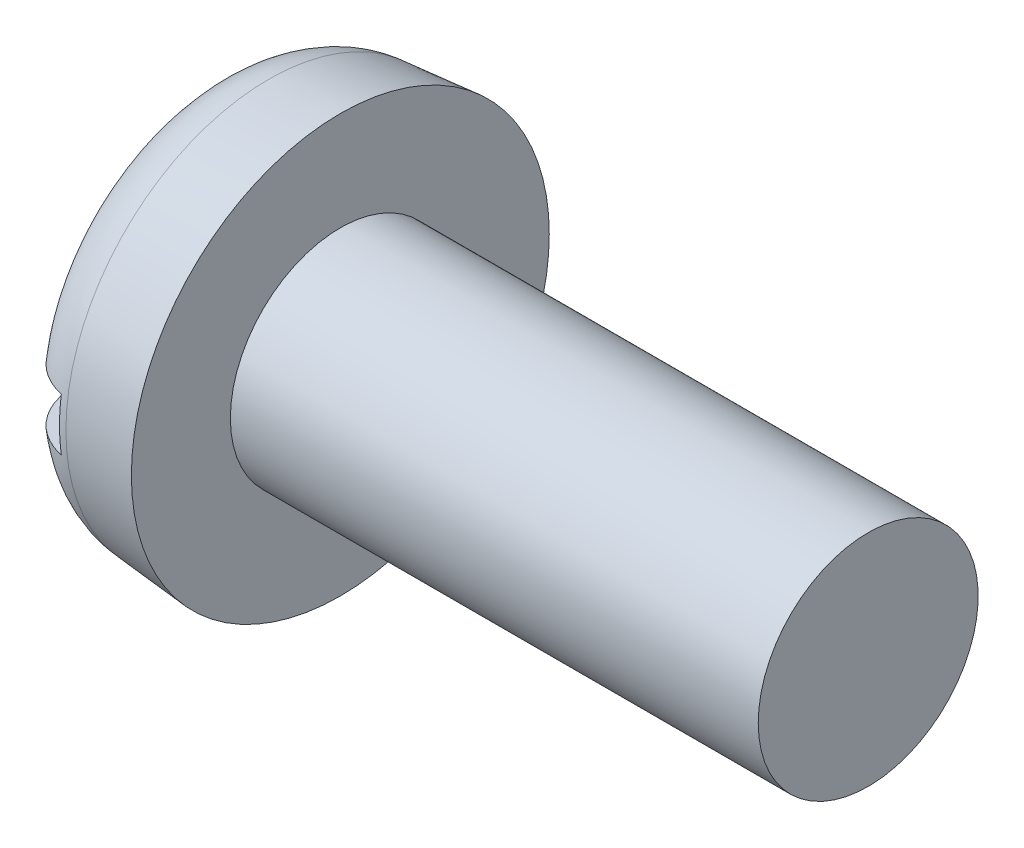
ISO-10303-21;
HEADER;
FILE_DESCRIPTION(('STEP AP214'),'2;1');
FILE_NAME('part.step','',(''),(''),'','','');
FILE_SCHEMA(('AUTOMOTIVE_DESIGN { 1 0 10303 214 1 1 1 1 }'));
ENDSEC;
DATA;
#1=APPLICATION_CONTEXT('core data for automotive mechanical design processes');
#2=APPLICATION_PROTOCOL_DEFINITION('international standard','automotive_design',2000,#1);
#3=PRODUCT_CONTEXT('',#1,'mechanical');
#4=PRODUCT('Part','Part','',(#3));
#5=PRODUCT_RELATED_PRODUCT_CATEGORY('part','',(#4));
#6=PRODUCT_DEFINITION_FORMATION('','',#4);
#7=PRODUCT_DEFINITION_CONTEXT('part definition',#1,'design');
#8=PRODUCT_DEFINITION('design','',#6,#7);
#9=PRODUCT_DEFINITION_SHAPE('','',#8);
#10=(LENGTH_UNIT() NAMED_UNIT(*) SI_UNIT(.MILLI.,.METRE.));
#11=(NAMED_UNIT(*) PLANE_ANGLE_UNIT() SI_UNIT($,.RADIAN.));
#12=(NAMED_UNIT(*) SI_UNIT($,.STERADIAN.) SOLID_ANGLE_UNIT());
#13=UNCERTAINTY_MEASURE_WITH_UNIT(LENGTH_MEASURE(1.E-05),#10,'distance_accuracy_value','');
#14=(GEOMETRIC_REPRESENTATION_CONTEXT(3) GLOBAL_UNCERTAINTY_ASSIGNED_CONTEXT((#13)) GLOBAL_UNIT_ASSIGNED_CONTEXT((#10,
#11,#12)) REPRESENTATION_CONTEXT('',''));
#15=CARTESIAN_POINT('',(0.,0.,0.));
#16=DIRECTION('',(0.,0.,1.));
#17=DIRECTION('',(1.,0.,0.));
#18=AXIS2_PLACEMENT_3D('',#15,#16,#17);
#19=CARTESIAN_POINT('',(0.,0.,0.));
#20=DIRECTION('',(-1.,0.,0.));
#21=DIRECTION('',(0.,0.,1.));
#22=AXIS2_PLACEMENT_3D('',#19,#20,#21);
#23=PLANE('',#22);
#24=DIRECTION('',(0.,0.,-1.));
#25=VECTOR('',#24,1.);
#26=CARTESIAN_POINT('',(0.,0.599999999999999,4.75));
#27=LINE('',#26,#25);
#28=CARTESIAN_POINT('',(0.,0.599999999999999,3.05466870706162));
#29=VERTEX_POINT('',#28);
#30=CARTESIAN_POINT('',(0.,0.599999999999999,-3.05466870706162));
#31=VERTEX_POINT('',#30);
#32=EDGE_CURVE('E85',#29,#31,#27,.T.);
#33=ORIENTED_EDGE('',*,*,#32,.F.);
#34=CARTESIAN_POINT('',(0.,0.,0.));
#35=DIRECTION('',(-1.,0.,0.));
#36=DIRECTION('',(0.,0.,1.));
#37=AXIS2_PLACEMENT_3D('',#34,#35,#36);
#38=CIRCLE('',#37,3.11303724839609);
#39=EDGE_CURVE('E91',#29,#31,#38,.T.);
#40=ORIENTED_EDGE('',*,*,#39,.T.);
#41=EDGE_LOOP('',(#33,#40));
#42=FACE_BOUND('',#41,.T.);
#43=ADVANCED_FACE('F32',(#42),#23,.T.);
#44=CARTESIAN_POINT('',(-25.4,0.,0.));
#45=DIRECTION('',(-1.,0.,0.));
#46=DIRECTION('',(0.,0.,1.));
#47=AXIS2_PLACEMENT_3D('',#44,#45,#46);
#48=CYLINDRICAL_SURFACE('',#47,2.5);
#49=CARTESIAN_POINT('',(15.,0.,0.));
#50=DIRECTION('',(-1.,0.,0.));
#51=DIRECTION('',(0.,0.,1.));
#52=AXIS2_PLACEMENT_3D('',#49,#50,#51);
#53=CIRCLE('',#52,2.5);
#54=CARTESIAN_POINT('',(15.,0.,2.5));
#55=VERTEX_POINT('',#54);
#56=EDGE_CURVE('E92',#55,#55,#53,.T.);
#57=ORIENTED_EDGE('',*,*,#56,.T.);
#58=EDGE_LOOP('',(#57));
#59=FACE_BOUND('',#58,.T.);
#60=CARTESIAN_POINT('',(3.,0.,0.));
#61=DIRECTION('',(-1.,0.,0.));
#62=DIRECTION('',(0.,0.,1.));
#63=AXIS2_PLACEMENT_3D('',#60,#61,#62);
#64=CIRCLE('',#63,2.5);
#65=CARTESIAN_POINT('',(3.,0.,2.5));
#66=VERTEX_POINT('',#65);
#67=EDGE_CURVE('E149',#66,#66,#64,.T.);
#68=ORIENTED_EDGE('',*,*,#67,.F.);
#69=EDGE_LOOP('',(#68));
#70=FACE_BOUND('',#69,.T.);
#71=ADVANCED_FACE('F137',(#59,#70),#48,.T.);
#72=CARTESIAN_POINT('',(15.,2.5,0.));
#73=DIRECTION('',(1.,0.,0.));
#74=DIRECTION('',(0.,0.,-1.));
#75=AXIS2_PLACEMENT_3D('',#72,#73,#74);
#76=PLANE('',#75);
#77=ORIENTED_EDGE('',*,*,#56,.F.);
#78=EDGE_LOOP('',(#77));
#79=FACE_BOUND('',#78,.T.);
#80=ADVANCED_FACE('F135',(#79),#76,.T.);
#81=DIRECTION('',(0.,0.,1.));
#82=VECTOR('',#81,1.);
#83=CARTESIAN_POINT('',(0.,-0.599999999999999,-4.75));
#84=LINE('',#83,#82);
#85=CARTESIAN_POINT('',(0.,-0.599999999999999,-3.05466870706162));
#86=VERTEX_POINT('',#85);
#87=CARTESIAN_POINT('',(0.,-0.6,3.05466870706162));
#88=VERTEX_POINT('',#87);
#89=EDGE_CURVE('E76',#86,#88,#84,.T.);
#90=ORIENTED_EDGE('',*,*,#89,.F.);
#91=EDGE_CURVE('E83',#86,#88,#38,.T.);
#92=ORIENTED_EDGE('',*,*,#91,.T.);
#93=EDGE_LOOP('',(#90,#92));
#94=FACE_BOUND('',#93,.T.);
#95=ADVANCED_FACE('F82',(#94),#23,.T.);
#96=CARTESIAN_POINT('',(0.,0.,0.));
#97=DIRECTION('',(1.,0.,0.));
#98=DIRECTION('',(0.,0.,-1.));
#99=AXIS2_PLACEMENT_3D('',#96,#97,#98);
#100=CONICAL_SURFACE('',#99,4.48753400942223,0.0872664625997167);
#101=CARTESIAN_POINT('',(1.36926638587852,0.,0.));
#102=DIRECTION('',(-1.,0.,0.));
#103=DIRECTION('',(0.,0.,1.));
#104=AXIS2_PLACEMENT_3D('',#101,#102,#103);
#105=CIRCLE('',#104,4.60732929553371);
#106=CARTESIAN_POINT('',(1.36926638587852,0.,4.60732929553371));
#107=VERTEX_POINT('',#106);
#108=EDGE_CURVE('E95',#107,#107,#105,.F.);
#109=ORIENTED_EDGE('',*,*,#108,.T.);
#110=EDGE_LOOP('',(#109));
#111=FACE_BOUND('',#110,.T.);
#112=CARTESIAN_POINT('',(3.,0.,0.));
#113=DIRECTION('',(-1.,0.,0.));
#114=DIRECTION('',(0.,0.,1.));
#115=AXIS2_PLACEMENT_3D('',#112,#113,#114);
#116=CIRCLE('',#115,4.75);
#117=CARTESIAN_POINT('',(3.,0.,4.75));
#118=VERTEX_POINT('',#117);
#119=EDGE_CURVE('E97',#118,#118,#116,.T.);
#120=ORIENTED_EDGE('',*,*,#119,.T.);
#121=EDGE_LOOP('',(#120));
#122=FACE_BOUND('',#121,.T.);
#123=ADVANCED_FACE('F128',(#111,#122),#100,.T.);
#124=CARTESIAN_POINT('',(3.,2.5,0.));
#125=DIRECTION('',(-1.,0.,0.));
#126=DIRECTION('',(0.,0.,1.));
#127=AXIS2_PLACEMENT_3D('',#124,#125,#126);
#128=PLANE('',#127);
#129=ORIENTED_EDGE('',*,*,#119,.F.);
#130=EDGE_LOOP('',(#129));
#131=FACE_BOUND('',#130,.T.);
#132=ORIENTED_EDGE('',*,*,#67,.T.);
#133=EDGE_LOOP('',(#132));
#134=FACE_BOUND('',#133,.T.);
#135=ADVANCED_FACE('F124',(#131,#134),#128,.F.);
#136=CARTESIAN_POINT('',(1.5,0.,0.));
#137=DIRECTION('',(-1.,0.,0.));
#138=DIRECTION('',(0.,0.,1.));
#139=AXIS2_PLACEMENT_3D('',#136,#137,#138);
#140=TOROIDAL_SURFACE('',#139,3.11303724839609,1.5);
#141=CARTESIAN_POINT('',(0.474243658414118,0.599999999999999,-4.16448807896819));
#142=CARTESIAN_POINT('',(0.535197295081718,0.599999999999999,-4.2222007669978));
#143=CARTESIAN_POINT('',(0.601040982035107,0.599999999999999,-4.27483380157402));
#144=CARTESIAN_POINT('',(0.740675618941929,0.599999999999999,-4.36835495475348));
#145=CARTESIAN_POINT('',(0.814475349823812,0.599999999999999,-4.40922990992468));
#146=CARTESIAN_POINT('',(0.967890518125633,0.599999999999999,-4.47797693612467));
#147=CARTESIAN_POINT('',(1.04750461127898,0.599999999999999,-4.50585200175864));
#148=CARTESIAN_POINT('',(1.21027286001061,0.599999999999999,-4.54777716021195));
#149=CARTESIAN_POINT('',(1.29342617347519,0.599999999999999,-4.56183052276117));
#150=CARTESIAN_POINT('',(1.46061786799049,0.599999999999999,-4.57568541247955));
#151=CARTESIAN_POINT('',(1.54465212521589,0.599999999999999,-4.57553672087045));
#152=CARTESIAN_POINT('',(1.71150157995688,0.599999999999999,-4.56111544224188));
#153=CARTESIAN_POINT('',(1.79431675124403,0.599999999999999,-4.546842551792));
#154=CARTESIAN_POINT('',(1.95628107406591,0.599999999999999,-4.50461633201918));
#155=CARTESIAN_POINT('',(2.03543426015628,0.599999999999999,-4.47667847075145));
#156=CARTESIAN_POINT('',(2.18794473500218,0.599999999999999,-4.40794662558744));
#157=CARTESIAN_POINT('',(2.26130200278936,0.599999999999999,-4.36715259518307));
#158=CARTESIAN_POINT('',(2.40037319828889,0.599999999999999,-4.27376142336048));
#159=CARTESIAN_POINT('',(2.46606492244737,0.599999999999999,-4.22113122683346));
#160=CARTESIAN_POINT('',(2.58775416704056,0.599999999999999,-4.10565865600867));
#161=CARTESIAN_POINT('',(2.64375146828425,0.599999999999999,-4.04281605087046));
#162=CARTESIAN_POINT('',(2.7448997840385,0.599999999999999,-3.90824759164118));
#163=CARTESIAN_POINT('',(2.78997229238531,0.599999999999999,-3.83646274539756));
#164=CARTESIAN_POINT('',(2.86758143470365,0.599999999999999,-3.6864129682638));
#165=CARTESIAN_POINT('',(2.90011748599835,0.599999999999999,-3.60814773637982));
#166=CARTESIAN_POINT('',(2.95215516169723,0.599999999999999,-3.44640006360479));
#167=CARTESIAN_POINT('',(2.9715017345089,0.599999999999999,-3.36286776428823));
#168=CARTESIAN_POINT('',(2.99613620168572,0.599999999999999,-3.19375865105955));
#169=CARTESIAN_POINT('',(3.00142305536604,0.599999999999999,-3.10818168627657));
#170=CARTESIAN_POINT('',(2.9978948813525,0.599999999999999,-2.93593785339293));
#171=CARTESIAN_POINT('',(2.98885075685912,0.599999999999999,-2.84927570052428));
#172=CARTESIAN_POINT('',(2.95661294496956,0.599999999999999,-2.67862588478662));
#173=CARTESIAN_POINT('',(2.93341783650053,0.599999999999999,-2.59463849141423));
#174=CARTESIAN_POINT('',(2.87305940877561,0.599999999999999,-2.43009011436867));
#175=CARTESIAN_POINT('',(2.8356478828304,0.599999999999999,-2.3496201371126));
#176=CARTESIAN_POINT('',(2.74798933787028,0.599999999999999,-2.1959917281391));
#177=CARTESIAN_POINT('',(2.69774036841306,0.599999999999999,-2.12283440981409));
#178=CARTESIAN_POINT('',(2.58515210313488,0.599999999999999,-1.98517825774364));
#179=CARTESIAN_POINT('',(2.52268993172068,0.599999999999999,-1.92077976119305));
#180=CARTESIAN_POINT('',(2.3876474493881,0.599999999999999,-1.80360821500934));
#181=CARTESIAN_POINT('',(2.31506700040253,0.599999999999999,-1.75083532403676));
#182=CARTESIAN_POINT('',(2.16324197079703,0.599999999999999,-1.65981326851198));
#183=CARTESIAN_POINT('',(2.08415844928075,0.599999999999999,-1.62129637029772));
#184=CARTESIAN_POINT('',(1.92036681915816,0.599999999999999,-1.55909823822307));
#185=CARTESIAN_POINT('',(1.83566227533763,0.599999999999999,-1.53540769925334));
#186=CARTESIAN_POINT('',(1.66868507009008,0.599999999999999,-1.50512561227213));
#187=CARTESIAN_POINT('',(1.58658829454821,0.599999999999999,-1.4975631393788));
#188=CARTESIAN_POINT('',(1.42235866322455,0.599999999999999,-1.49703912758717));
#189=CARTESIAN_POINT('',(1.34022582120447,0.599999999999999,-1.50407401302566));
#190=CARTESIAN_POINT('',(1.18200056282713,0.599999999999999,-1.53172166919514));
#191=CARTESIAN_POINT('',(1.10580089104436,0.599999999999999,-1.55172937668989));
#192=CARTESIAN_POINT('',(0.957649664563,0.599999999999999,-1.60381093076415));
#193=CARTESIAN_POINT('',(0.885698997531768,0.599999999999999,-1.63588728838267));
#194=CARTESIAN_POINT('',(0.745245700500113,0.599999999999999,-1.71223681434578));
#195=CARTESIAN_POINT('',(0.676958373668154,0.599999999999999,-1.75690511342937));
#196=CARTESIAN_POINT('',(0.548253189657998,0.599999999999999,-1.85641398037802));
#197=CARTESIAN_POINT('',(0.487837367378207,0.599999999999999,-1.91125716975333));
#198=CARTESIAN_POINT('',(0.372604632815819,0.599999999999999,-2.0333995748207));
#199=CARTESIAN_POINT('',(0.318393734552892,0.599999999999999,-2.10127142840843));
#200=CARTESIAN_POINT('',(0.22172170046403,0.599999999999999,-2.24492747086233));
#201=CARTESIAN_POINT('',(0.179262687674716,0.599999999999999,-2.32071308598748));
#202=CARTESIAN_POINT('',(0.106126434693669,0.599999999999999,-2.48060945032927));
#203=CARTESIAN_POINT('',(0.0758504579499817,0.599999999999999,-2.56490423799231));
#204=CARTESIAN_POINT('',(0.0299480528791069,0.599999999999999,-2.737393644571));
#205=CARTESIAN_POINT('',(0.0143211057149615,0.599999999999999,-2.82558812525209));
#206=CARTESIAN_POINT('',(-0.00166405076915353,0.599999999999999,-3.00295249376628));
#207=CARTESIAN_POINT('',(-0.0020913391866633,0.599999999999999,-3.09211612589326));
#208=CARTESIAN_POINT('',(0.012315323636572,0.599999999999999,-3.26923006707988));
#209=CARTESIAN_POINT('',(0.0271518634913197,0.599999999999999,-3.35718016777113));
#210=CARTESIAN_POINT('',(0.0713942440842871,0.599999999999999,-3.52770551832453));
#211=CARTESIAN_POINT('',(0.100543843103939,0.599999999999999,-3.61034739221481));
#212=CARTESIAN_POINT('',(0.172532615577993,0.599999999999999,-3.7693538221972));
#213=CARTESIAN_POINT('',(0.215353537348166,0.599999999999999,-3.84572657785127));
#214=CARTESIAN_POINT('',(0.294810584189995,0.599999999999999,-3.9625299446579));
#215=CARTESIAN_POINT('',(0.327631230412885,0.599999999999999,-4.00560511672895));
#216=CARTESIAN_POINT('',(0.397705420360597,0.599999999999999,-4.08798619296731));
#217=CARTESIAN_POINT('',(0.434958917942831,0.599999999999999,-4.12729213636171));
#218=CARTESIAN_POINT('',(0.474243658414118,0.599999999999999,-4.16448807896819));
#219=B_SPLINE_CURVE_WITH_KNOTS('',3,(#141,#142,#143,#144,#145,#146,#147,#148,#149,#150,#151,
#152,#153,#154,#155,#156,#157,#158,#159,#160,#161,#162,#163,#164,#165,#166,#167,#168,#169,#170,
#171,#172,#173,#174,#175,#176,#177,#178,#179,#180,#181,#182,#183,#184,#185,#186,#187,#188,#189,
#190,#191,#192,#193,#194,#195,#196,#197,#198,#199,#200,#201,#202,#203,#204,#205,#206,#207,#208,
#209,#210,#211,#212,#213,#214,#215,#216,#217,#218),.UNSPECIFIED.,.T.,.F.,(4,2,2,2,2,2,2,2,2,2,2,
2,2,2,2,2,2,2,2,2,2,2,2,2,2,2,2,2,2,2,2,2,2,2,2,2,2,2,4),(0.,0.251627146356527,
0.503534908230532,0.755384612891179,1.00717472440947,1.25808229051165,1.50899524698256,
1.75962483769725,2.01025533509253,2.26159466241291,2.5129396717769,2.76604060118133,
3.01915329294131,3.27519243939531,3.53125053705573,3.79144347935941,4.05166255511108,
4.31665070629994,4.58167914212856,4.84952563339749,5.1173757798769,5.37990411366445,
5.64226751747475,5.88833003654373,6.13433228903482,6.36961414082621,6.60494497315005,
6.84869102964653,7.09249997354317,7.35191672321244,7.61138030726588,7.87880123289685,
8.14621268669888,8.41240865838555,8.67864978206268,8.94028930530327,9.20158098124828,
9.36375686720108,9.52593106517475),.UNSPECIFIED.);
#220=CARTESIAN_POINT('',(1.2,0.599999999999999,-4.54328342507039));
#221=VERTEX_POINT('',#220);
#222=EDGE_CURVE('E11',#31,#221,#219,.T.);
#223=ORIENTED_EDGE('',*,*,#222,.F.);
#224=ORIENTED_EDGE('',*,*,#39,.F.);
#225=CARTESIAN_POINT('',(0.642058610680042,0.599999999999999,1.78444467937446));
#226=CARTESIAN_POINT('',(0.708203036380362,0.599999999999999,1.73578880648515));
#227=CARTESIAN_POINT('',(0.778279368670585,0.599999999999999,1.69241067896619));
#228=CARTESIAN_POINT('',(0.924661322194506,0.599999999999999,1.61775076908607));
#229=CARTESIAN_POINT('',(1.00097010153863,0.599999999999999,1.58647516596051));
#230=CARTESIAN_POINT('',(1.15801751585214,0.599999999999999,1.537335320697));
#231=CARTESIAN_POINT('',(1.23876602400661,0.599999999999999,1.51950238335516));
#232=CARTESIAN_POINT('',(1.40212199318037,0.599999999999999,1.49831173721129));
#233=CARTESIAN_POINT('',(1.48472861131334,0.599999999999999,1.49494759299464));
#234=CARTESIAN_POINT('',(1.64595983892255,0.599999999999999,1.50270631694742));
#235=CARTESIAN_POINT('',(1.72461257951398,0.599999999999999,1.51326068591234));
#236=CARTESIAN_POINT('',(1.8790539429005,0.599999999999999,1.54733501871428));
#237=CARTESIAN_POINT('',(1.95484205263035,0.599999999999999,1.57085729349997));
#238=CARTESIAN_POINT('',(2.10217401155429,0.599999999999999,1.63005609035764));
#239=CARTESIAN_POINT('',(2.17368023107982,0.599999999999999,1.6658257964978));
#240=CARTESIAN_POINT('',(2.310172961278,0.599999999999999,1.74815983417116));
#241=CARTESIAN_POINT('',(2.37515789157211,0.599999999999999,1.79472677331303));
#242=CARTESIAN_POINT('',(2.50111037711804,0.599999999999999,1.90052230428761));
#243=CARTESIAN_POINT('',(2.56156048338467,0.599999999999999,1.96036731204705));
#244=CARTESIAN_POINT('',(2.67210720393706,0.599999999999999,2.08896077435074));
#245=CARTESIAN_POINT('',(2.72220143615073,0.599999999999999,2.15771127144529));
#246=CARTESIAN_POINT('',(2.81284735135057,0.599999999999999,2.30563751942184));
#247=CARTESIAN_POINT('',(2.85285618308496,0.599999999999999,2.38514674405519));
#248=CARTESIAN_POINT('',(2.91905433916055,0.599999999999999,2.54972911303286));
#249=CARTESIAN_POINT('',(2.94524280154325,0.599999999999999,2.63480260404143));
#250=CARTESIAN_POINT('',(2.98307112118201,0.599999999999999,2.80866920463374));
#251=CARTESIAN_POINT('',(2.9946229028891,0.599999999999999,2.89748154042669));
#252=CARTESIAN_POINT('',(3.00240662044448,0.599999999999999,3.07577878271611));
#253=CARTESIAN_POINT('',(2.998639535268,0.599999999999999,3.16526364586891));
#254=CARTESIAN_POINT('',(2.97592433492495,0.599999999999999,3.34090743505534));
#255=CARTESIAN_POINT('',(2.95720740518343,0.599999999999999,3.42709622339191));
#256=CARTESIAN_POINT('',(2.90529569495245,0.599999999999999,3.59499998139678));
#257=CARTESIAN_POINT('',(2.87210231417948,0.599999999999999,3.67671538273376));
#258=CARTESIAN_POINT('',(2.7928517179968,0.599999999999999,3.83175947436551));
#259=CARTESIAN_POINT('',(2.7470416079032,0.599999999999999,3.90521449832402));
#260=CARTESIAN_POINT('',(2.64356788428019,0.599999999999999,4.04323981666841));
#261=CARTESIAN_POINT('',(2.58590525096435,0.599999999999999,4.10781084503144));
#262=CARTESIAN_POINT('',(2.46128327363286,0.599999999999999,4.22525214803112));
#263=CARTESIAN_POINT('',(2.39447165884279,0.599999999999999,4.27827922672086));
#264=CARTESIAN_POINT('',(2.25282231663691,0.599999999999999,4.37223374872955));
#265=CARTESIAN_POINT('',(2.17798504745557,0.599999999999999,4.41316188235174));
#266=CARTESIAN_POINT('',(2.02319107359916,0.599999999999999,4.48136089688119));
#267=CARTESIAN_POINT('',(1.94329070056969,0.599999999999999,4.50875968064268));
#268=CARTESIAN_POINT('',(1.78001182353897,0.599999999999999,4.54967680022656));
#269=CARTESIAN_POINT('',(1.69663343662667,0.599999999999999,4.5631956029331));
#270=CARTESIAN_POINT('',(1.52922201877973,0.599999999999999,4.57591948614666));
#271=CARTESIAN_POINT('',(1.44519451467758,0.599999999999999,4.57519739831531));
#272=CARTESIAN_POINT('',(1.27845728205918,0.599999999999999,4.55963992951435));
#273=CARTESIAN_POINT('',(1.19574753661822,0.599999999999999,4.54480472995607));
#274=CARTESIAN_POINT('',(1.0340786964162,0.599999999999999,4.50147996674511));
#275=CARTESIAN_POINT('',(0.95511580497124,0.599999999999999,4.47300456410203));
#276=CARTESIAN_POINT('',(0.803072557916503,0.599999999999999,4.40323812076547));
#277=CARTESIAN_POINT('',(0.729992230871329,0.599999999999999,4.36194701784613));
#278=CARTESIAN_POINT('',(0.59154832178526,0.599999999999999,4.26761123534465));
#279=CARTESIAN_POINT('',(0.526207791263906,0.599999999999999,4.21453273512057));
#280=CARTESIAN_POINT('',(0.405289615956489,0.599999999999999,4.09822911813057));
#281=CARTESIAN_POINT('',(0.349712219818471,0.599999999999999,4.03500374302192));
#282=CARTESIAN_POINT('',(0.249458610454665,0.599999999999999,3.89973755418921));
#283=CARTESIAN_POINT('',(0.204862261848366,0.599999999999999,3.82763756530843));
#284=CARTESIAN_POINT('',(0.128249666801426,0.599999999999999,3.67704118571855));
#285=CARTESIAN_POINT('',(0.0962340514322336,0.599999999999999,3.59854447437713));
#286=CARTESIAN_POINT('',(0.0452695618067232,0.599999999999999,3.43641182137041));
#287=CARTESIAN_POINT('',(0.0264776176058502,0.599999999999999,3.35272657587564));
#288=CARTESIAN_POINT('',(0.00296961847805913,0.599999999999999,3.18340853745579));
#289=CARTESIAN_POINT('',(-0.00174593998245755,0.599999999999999,3.09777567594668));
#290=CARTESIAN_POINT('',(0.00293340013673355,0.599999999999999,2.92551527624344));
#291=CARTESIAN_POINT('',(0.0125572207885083,0.599999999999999,2.83889398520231));
#292=CARTESIAN_POINT('',(0.045943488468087,0.599999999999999,2.66839997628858));
#293=CARTESIAN_POINT('',(0.0697105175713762,0.599999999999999,2.58452815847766));
#294=CARTESIAN_POINT('',(0.131206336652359,0.599999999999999,2.42028022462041));
#295=CARTESIAN_POINT('',(0.169188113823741,0.599999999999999,2.3399989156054));
#296=CARTESIAN_POINT('',(0.257932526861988,0.599999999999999,2.18690708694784));
#297=CARTESIAN_POINT('',(0.308683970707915,0.599999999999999,2.11409010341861));
#298=CARTESIAN_POINT('',(0.405756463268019,0.599999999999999,1.9970345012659));
#299=CARTESIAN_POINT('',(0.449343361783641,0.599999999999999,1.9505006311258));
#300=CARTESIAN_POINT('',(0.54185180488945,0.599999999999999,1.86306846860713));
#301=CARTESIAN_POINT('',(0.590773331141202,0.599999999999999,1.82217015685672));
#302=CARTESIAN_POINT('',(0.642058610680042,0.599999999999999,1.78444467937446));
#303=B_SPLINE_CURVE_WITH_KNOTS('',3,(#225,#226,#227,#228,#229,#230,#231,#232,#233,#234,#235,
#236,#237,#238,#239,#240,#241,#242,#243,#244,#245,#246,#247,#248,#249,#250,#251,#252,#253,#254,
#255,#256,#257,#258,#259,#260,#261,#262,#263,#264,#265,#266,#267,#268,#269,#270,#271,#272,#273,
#274,#275,#276,#277,#278,#279,#280,#281,#282,#283,#284,#285,#286,#287,#288,#289,#290,#291,#292,
#293,#294,#295,#296,#297,#298,#299,#300,#301,#302),.UNSPECIFIED.,.T.,.F.,(4,2,2,2,2,2,2,2,2,2,2,
2,2,2,2,2,2,2,2,2,2,2,2,2,2,2,2,2,2,2,2,2,2,2,2,2,2,2,4),(0.,0.24612605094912,0.492377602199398,
0.739200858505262,0.985914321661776,1.22285638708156,1.45984069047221,1.69866969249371,
1.93755643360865,2.19161852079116,2.4457389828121,2.7115111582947,2.97729990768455,
3.24468054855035,3.51204410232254,3.77535136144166,4.03863316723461,4.29708605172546,
4.55551757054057,4.81018291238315,5.06483372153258,5.31702870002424,5.56921519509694,
5.82011227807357,6.07100613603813,6.32164008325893,6.57227524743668,6.8236390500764,
7.07500925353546,7.32815697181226,7.58131738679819,7.83743366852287,8.09355898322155,
8.35381727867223,8.61415993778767,8.87937525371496,9.14435892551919,9.33519415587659,
9.52602873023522),.UNSPECIFIED.);
#304=CARTESIAN_POINT('',(1.2,0.599999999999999,4.54328342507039));
#305=VERTEX_POINT('',#304);
#306=EDGE_CURVE('E109',#305,#29,#303,.T.);
#307=ORIENTED_EDGE('',*,*,#306,.F.);
#308=CARTESIAN_POINT('',(1.2,0.,0.));
#309=DIRECTION('',(-1.,0.,0.));
#310=DIRECTION('',(0.,0.,1.));
#311=AXIS2_PLACEMENT_3D('',#308,#309,#310);
#312=CIRCLE('',#311,4.582731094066);
#313=CARTESIAN_POINT('',(1.2,-0.6,4.54328342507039));
#314=VERTEX_POINT('',#313);
#315=EDGE_CURVE('E103',#305,#314,#312,.F.);
#316=ORIENTED_EDGE('',*,*,#315,.T.);
#317=CARTESIAN_POINT('',(0.642058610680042,-0.6,1.78444467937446));
#318=CARTESIAN_POINT('',(0.570752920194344,-0.6,1.83690352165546));
#319=CARTESIAN_POINT('',(0.503916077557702,-0.6,1.89557553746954));
#320=CARTESIAN_POINT('',(0.380973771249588,-0.6,2.02337981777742));
#321=CARTESIAN_POINT('',(0.324888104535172,-0.6,2.09253096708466));
#322=CARTESIAN_POINT('',(0.225075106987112,-0.6,2.23912059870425));
#323=CARTESIAN_POINT('',(0.181331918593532,-0.6,2.31654826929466));
#324=CARTESIAN_POINT('',(0.10735821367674,-0.6,2.4775679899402));
#325=CARTESIAN_POINT('',(0.0771217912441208,-0.6,2.56115732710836));
#326=CARTESIAN_POINT('',(0.0308710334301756,-0.6,2.732939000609));
#327=CARTESIAN_POINT('',(0.0149771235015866,-0.6,2.82116384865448));
#328=CARTESIAN_POINT('',(-0.0015567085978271,-0.6,2.99904386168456));
#329=CARTESIAN_POINT('',(-0.00219606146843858,-0.6,3.08869907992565));
#330=CARTESIAN_POINT('',(0.0118531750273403,-0.6,3.26558059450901));
#331=CARTESIAN_POINT('',(0.0263341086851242,-0.6,3.35282334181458));
#332=CARTESIAN_POINT('',(0.0700194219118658,-0.6,3.52354291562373));
#333=CARTESIAN_POINT('',(0.099222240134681,-0.6,3.60702014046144));
#334=CARTESIAN_POINT('',(0.170926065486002,-0.6,3.76619303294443));
#335=CARTESIAN_POINT('',(0.213170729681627,-0.6,3.84200419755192));
#336=CARTESIAN_POINT('',(0.309975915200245,-0.6,3.98530836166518));
#337=CARTESIAN_POINT('',(0.364535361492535,-0.6,4.05280208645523));
#338=CARTESIAN_POINT('',(0.483508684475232,-0.6,4.1764763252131));
#339=CARTESIAN_POINT('',(0.5477595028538,-0.6,4.23281374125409));
#340=CARTESIAN_POINT('',(0.684891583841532,-0.6,4.33376627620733));
#341=CARTESIAN_POINT('',(0.757772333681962,-0.6,4.37838209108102));
#342=CARTESIAN_POINT('',(0.909277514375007,-0.6,4.45415785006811));
#343=CARTESIAN_POINT('',(0.98783477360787,-0.6,4.4854521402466));
#344=CARTESIAN_POINT('',(1.14910626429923,-0.6,4.53432193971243));
#345=CARTESIAN_POINT('',(1.23182034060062,-0.6,4.55189796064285));
#346=CARTESIAN_POINT('',(1.39854874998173,-0.6,4.57274942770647));
#347=CARTESIAN_POINT('',(1.48255291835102,-0.6,4.57610622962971));
#348=CARTESIAN_POINT('',(1.64992840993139,-0.6,4.56864397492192));
#349=CARTESIAN_POINT('',(1.73329974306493,-0.6,4.55782514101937));
#350=CARTESIAN_POINT('',(1.89690556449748,-0.6,4.5223590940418));
#351=CARTESIAN_POINT('',(1.97714487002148,-0.6,4.49773409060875));
#352=CARTESIAN_POINT('',(2.13236381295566,-0.6,4.43539277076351));
#353=CARTESIAN_POINT('',(2.20734343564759,-0.6,4.39767641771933));
#354=CARTESIAN_POINT('',(2.35011399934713,-0.6,4.31014761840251));
#355=CARTESIAN_POINT('',(2.41788774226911,-0.6,4.26030712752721));
#356=CARTESIAN_POINT('',(2.54417141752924,-0.6,4.15002218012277));
#357=CARTESIAN_POINT('',(2.60268114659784,-0.6,4.08957749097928));
#358=CARTESIAN_POINT('',(2.70919785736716,-0.6,3.9593981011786));
#359=CARTESIAN_POINT('',(2.75713464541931,-0.6,3.88960598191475));
#360=CARTESIAN_POINT('',(2.84075534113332,-0.6,3.74303514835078));
#361=CARTESIAN_POINT('',(2.8764387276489,-0.6,3.66625613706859));
#362=CARTESIAN_POINT('',(2.93498131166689,-0.6,3.50699921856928));
#363=CARTESIAN_POINT('',(2.95769541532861,-0.6,3.42446799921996));
#364=CARTESIAN_POINT('',(2.98917609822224,-0.6,3.25679047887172));
#365=CARTESIAN_POINT('',(2.99794169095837,-0.6,3.17164399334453));
#366=CARTESIAN_POINT('',(3.00144063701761,-0.6,2.99973325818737));
#367=CARTESIAN_POINT('',(2.99595250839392,-0.6,2.91296452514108));
#368=CARTESIAN_POINT('',(2.97076041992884,-0.6,2.74151789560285));
#369=CARTESIAN_POINT('',(2.95105508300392,-0.6,2.6568402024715));
#370=CARTESIAN_POINT('',(2.8975856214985,-0.6,2.49032583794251));
#371=CARTESIAN_POINT('',(2.86356984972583,-0.6,2.40856994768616));
#372=CARTESIAN_POINT('',(2.78246737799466,-0.6,2.25181146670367));
#373=CARTESIAN_POINT('',(2.73537879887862,-0.6,2.17680984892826));
#374=CARTESIAN_POINT('',(2.6287380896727,-0.6,2.03476656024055));
#375=CARTESIAN_POINT('',(2.56903700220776,-0.6,1.96783656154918));
#376=CARTESIAN_POINT('',(2.43909597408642,-0.6,1.84509773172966));
#377=CARTESIAN_POINT('',(2.36885525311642,-0.6,1.7892897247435));
#378=CARTESIAN_POINT('',(2.22077231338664,-0.6,1.6915159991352));
#379=CARTESIAN_POINT('',(2.14305625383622,-0.6,1.64935982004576));
#380=CARTESIAN_POINT('',(1.98134627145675,-0.6,1.57962775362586));
#381=CARTESIAN_POINT('',(1.89735630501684,-0.6,1.55204276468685));
#382=CARTESIAN_POINT('',(1.73074700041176,-0.6,1.51405337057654));
#383=CARTESIAN_POINT('',(1.64833577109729,-0.6,1.50273689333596));
#384=CARTESIAN_POINT('',(1.48280159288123,-0.6,1.49493998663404));
#385=CARTESIAN_POINT('',(1.39967868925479,-0.6,1.49845862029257));
#386=CARTESIAN_POINT('',(1.23954957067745,-0.6,1.5195684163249));
#387=CARTESIAN_POINT('',(1.16244637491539,-0.6,1.53644040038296));
#388=CARTESIAN_POINT('',(1.01210690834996,-0.6,1.58254863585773));
#389=CARTESIAN_POINT('',(0.938866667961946,-0.6,1.61177190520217));
#390=CARTESIAN_POINT('',(0.828774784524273,-0.6,1.66615585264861));
#391=CARTESIAN_POINT('',(0.789995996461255,-0.6,1.68752043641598));
#392=CARTESIAN_POINT('',(0.714458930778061,-0.6,1.73355428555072));
#393=CARTESIAN_POINT('',(0.677700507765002,-0.6,1.75822331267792));
#394=CARTESIAN_POINT('',(0.642058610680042,-0.6,1.78444467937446));
#395=B_SPLINE_CURVE_WITH_KNOTS('',3,(#317,#318,#319,#320,#321,#322,#323,#324,#325,#326,#327,
#328,#329,#330,#331,#332,#333,#334,#335,#336,#337,#338,#339,#340,#341,#342,#343,#344,#345,#346,
#347,#348,#349,#350,#351,#352,#353,#354,#355,#356,#357,#358,#359,#360,#361,#362,#363,#364,#365,
#366,#367,#368,#369,#370,#371,#372,#373,#374,#375,#376,#377,#378,#379,#380,#381,#382,#383,#384,
#385,#386,#387,#388,#389,#390,#391,#392,#393,#394),.UNSPECIFIED.,.T.,.F.,(4,2,2,2,2,2,2,2,2,2,2,
2,2,2,2,2,2,2,2,2,2,2,2,2,2,2,2,2,2,2,2,2,2,2,2,2,2,2,4),(0.,0.265404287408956,
0.531292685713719,0.796837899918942,1.0622668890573,1.32990433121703,1.59755176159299,
1.86157117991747,2.12556260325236,2.38466409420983,2.64374297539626,2.89886888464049,
3.15397964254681,3.40645291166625,3.65891676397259,3.90993416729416,4.16094762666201,
4.41155844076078,4.66216995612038,4.91336677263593,5.1645691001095,5.41739205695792,
5.67022576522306,5.92583525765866,6.18146282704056,6.44108615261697,6.70073462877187,
6.96515356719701,7.22961053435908,7.49738541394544,7.76518012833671,8.0290593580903,
8.2927735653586,8.54103382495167,8.78927840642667,9.02499451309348,9.2604634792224,
9.39313443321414,9.5257958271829),.UNSPECIFIED.);
#396=EDGE_CURVE('E90',#88,#314,#395,.T.);
#397=ORIENTED_EDGE('',*,*,#396,.F.);
#398=ORIENTED_EDGE('',*,*,#91,.F.);
#399=CARTESIAN_POINT('',(0.474243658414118,-0.599999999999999,-4.16448807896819));
#400=CARTESIAN_POINT('',(0.412409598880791,-0.599999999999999,-4.10593108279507));
#401=CARTESIAN_POINT('',(0.35551684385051,-0.599999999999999,-4.04205754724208));
#402=CARTESIAN_POINT('',(0.253261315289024,-0.599999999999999,-3.90557965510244));
#403=CARTESIAN_POINT('',(0.207914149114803,-0.599999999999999,-3.83296367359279));
#404=CARTESIAN_POINT('',(0.130063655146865,-0.599999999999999,-3.68123851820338));
#405=CARTESIAN_POINT('',(0.0975468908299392,-0.599999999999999,-3.6021362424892));
#406=CARTESIAN_POINT('',(0.0461131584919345,-0.599999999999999,-3.43965944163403));
#407=CARTESIAN_POINT('',(0.027192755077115,-0.599999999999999,-3.35628600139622));
#408=CARTESIAN_POINT('',(0.00320871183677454,-0.599999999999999,-3.18666752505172));
#409=CARTESIAN_POINT('',(-0.00170544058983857,-0.599999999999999,-3.10040138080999));
#410=CARTESIAN_POINT('',(0.00275015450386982,-0.599999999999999,-2.92823768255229));
#411=CARTESIAN_POINT('',(0.012121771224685,-0.599999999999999,-2.84234017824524));
#412=CARTESIAN_POINT('',(0.0450616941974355,-0.599999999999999,-2.67171740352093));
#413=CARTESIAN_POINT('',(0.0688809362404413,-0.6,-2.58704058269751));
#414=CARTESIAN_POINT('',(0.130163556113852,-0.6,-2.42277478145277));
#415=CARTESIAN_POINT('',(0.16762851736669,-0.6,-2.34318639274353));
#416=CARTESIAN_POINT('',(0.255857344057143,-0.6,-2.19000637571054));
#417=CARTESIAN_POINT('',(0.306828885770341,-0.6,-2.11653425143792));
#418=CARTESIAN_POINT('',(0.420399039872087,-0.6,-1.97917572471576));
#419=CARTESIAN_POINT('',(0.482999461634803,-0.6,-1.91529081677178));
#420=CARTESIAN_POINT('',(0.618096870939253,-0.6,-1.79922493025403));
#421=CARTESIAN_POINT('',(0.69057820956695,-0.6,-1.74702578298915));
#422=CARTESIAN_POINT('',(0.843593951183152,-0.6,-1.65617143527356));
#423=CARTESIAN_POINT('',(0.924125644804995,-0.6,-1.61751169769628));
#424=CARTESIAN_POINT('',(1.08726160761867,-0.6,-1.5568894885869));
#425=CARTESIAN_POINT('',(1.16962117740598,-0.6,-1.53427068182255));
#426=CARTESIAN_POINT('',(1.33705452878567,-0.6,-1.50426955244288));
#427=CARTESIAN_POINT('',(1.42212670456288,-0.6,-1.49687837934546));
#428=CARTESIAN_POINT('',(1.58668515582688,-0.6,-1.4977182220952));
#429=CARTESIAN_POINT('',(1.66617813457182,-0.6,-1.50497326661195));
#430=CARTESIAN_POINT('',(1.82279518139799,-0.6,-1.53279061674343));
#431=CARTESIAN_POINT('',(1.89991905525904,-0.6,-1.55335401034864));
#432=CARTESIAN_POINT('',(2.04948924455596,-0.6,-1.6067410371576));
#433=CARTESIAN_POINT('',(2.1219498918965,-0.6,-1.63952477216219));
#434=CARTESIAN_POINT('',(2.26079027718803,-0.6,-1.71610282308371));
#435=CARTESIAN_POINT('',(2.32716854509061,-0.6,-1.75989979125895));
#436=CARTESIAN_POINT('',(2.45624783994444,-0.6,-1.86010993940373));
#437=CARTESIAN_POINT('',(2.51847841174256,-0.6,-1.91712921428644));
#438=CARTESIAN_POINT('',(2.6330655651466,-0.6,-2.04035161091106));
#439=CARTESIAN_POINT('',(2.68541975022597,-0.6,-2.10655695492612));
#440=CARTESIAN_POINT('',(2.78137899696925,-0.6,-2.24995520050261));
#441=CARTESIAN_POINT('',(2.82440841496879,-0.6,-2.32753422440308));
#442=CARTESIAN_POINT('',(2.89698988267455,-0.6,-2.48876491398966));
#443=CARTESIAN_POINT('',(2.92654080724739,-0.599999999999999,-2.57241708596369));
#444=CARTESIAN_POINT('',(2.97147838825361,-0.599999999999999,-2.74436421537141));
#445=CARTESIAN_POINT('',(2.98671795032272,-0.599999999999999,-2.83269773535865));
#446=CARTESIAN_POINT('',(3.0019280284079,-0.599999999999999,-3.01067371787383));
#447=CARTESIAN_POINT('',(3.00189936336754,-0.599999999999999,-3.10031610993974));
#448=CARTESIAN_POINT('',(2.98653324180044,-0.599999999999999,-3.27703669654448));
#449=CARTESIAN_POINT('',(2.97140689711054,-0.599999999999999,-3.36413320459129));
#450=CARTESIAN_POINT('',(2.92646546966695,-0.599999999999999,-3.53445278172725));
#451=CARTESIAN_POINT('',(2.89665181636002,-0.599999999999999,-3.6176762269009));
#452=CARTESIAN_POINT('',(2.82379055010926,-0.599999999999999,-3.77624709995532));
#453=CARTESIAN_POINT('',(2.78099811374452,-0.599999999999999,-3.85171179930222));
#454=CARTESIAN_POINT('',(2.68316564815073,-0.599999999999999,-3.99423591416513));
#455=CARTESIAN_POINT('',(2.62812664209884,-0.599999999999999,-4.06129603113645));
#456=CARTESIAN_POINT('',(2.50827792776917,-0.599999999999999,-4.18404243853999));
#457=CARTESIAN_POINT('',(2.44362896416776,-0.599999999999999,-4.23988572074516));
#458=CARTESIAN_POINT('',(2.3057910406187,-0.599999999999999,-4.33979100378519));
#459=CARTESIAN_POINT('',(2.23260257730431,-0.599999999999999,-4.38385368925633));
#460=CARTESIAN_POINT('',(2.08057460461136,-0.599999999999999,-4.45849174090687));
#461=CARTESIAN_POINT('',(2.00180044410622,-0.599999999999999,-4.4892002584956));
#462=CARTESIAN_POINT('',(1.84020059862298,-0.599999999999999,-4.53687031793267));
#463=CARTESIAN_POINT('',(1.75737522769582,-0.599999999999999,-4.55383292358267));
#464=CARTESIAN_POINT('',(1.59053176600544,-0.599999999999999,-4.5734537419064));
#465=CARTESIAN_POINT('',(1.50652325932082,-0.599999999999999,-4.57619356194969));
#466=CARTESIAN_POINT('',(1.33921886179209,-0.599999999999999,-4.56750581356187));
#467=CARTESIAN_POINT('',(1.25592315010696,-0.599999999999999,-4.55607478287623));
#468=CARTESIAN_POINT('',(1.09252935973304,-0.599999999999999,-4.51940184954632));
#469=CARTESIAN_POINT('',(1.01242810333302,-0.599999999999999,-4.49417405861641));
#470=CARTESIAN_POINT('',(0.857658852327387,-0.599999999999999,-4.4306700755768));
#471=CARTESIAN_POINT('',(0.782984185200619,-0.599999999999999,-4.39241024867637));
#472=CARTESIAN_POINT('',(0.669478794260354,-0.599999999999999,-4.32168602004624));
#473=CARTESIAN_POINT('',(0.628240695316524,-0.599999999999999,-4.29300657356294));
#474=CARTESIAN_POINT('',(0.548844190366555,-0.599999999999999,-4.23166298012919));
#475=CARTESIAN_POINT('',(0.510685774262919,-0.599999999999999,-4.1989988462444));
#476=CARTESIAN_POINT('',(0.474243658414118,-0.599999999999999,-4.16448807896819));
#477=B_SPLINE_CURVE_WITH_KNOTS('',3,(#399,#400,#401,#402,#403,#404,#405,#406,#407,#408,#409,
#410,#411,#412,#413,#414,#415,#416,#417,#418,#419,#420,#421,#422,#423,#424,#425,#426,#427,#428,
#429,#430,#431,#432,#433,#434,#435,#436,#437,#438,#439,#440,#441,#442,#443,#444,#445,#446,#447,
#448,#449,#450,#451,#452,#453,#454,#455,#456,#457,#458,#459,#460,#461,#462,#463,#464,#465,#466,
#467,#468,#469,#470,#471,#472,#473,#474,#475,#476),.UNSPECIFIED.,.T.,.F.,(4,2,2,2,2,2,2,2,2,2,2,
2,2,2,2,2,2,2,2,2,2,2,2,2,2,2,2,2,2,2,2,2,2,2,2,2,2,2,4),(0.,0.25529644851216,0.510936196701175,
0.766307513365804,1.02161428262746,1.27963589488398,1.53769127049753,1.80036244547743,
2.06306411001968,2.330066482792,2.5971104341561,2.86373626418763,3.13027266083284,
3.38515155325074,3.63988226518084,3.87819866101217,4.11653454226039,4.35409900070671,
4.59172072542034,4.84382021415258,5.09598079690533,5.36088081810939,5.62580294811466,
5.89341910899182,6.16102091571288,6.42493252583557,6.6888184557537,6.94781983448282,
7.20679958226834,7.46185384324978,7.71689327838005,7.96932796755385,8.22174311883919,
8.47270835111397,8.72373491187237,8.97450519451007,9.22496172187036,9.37542205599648,
9.52588189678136),.UNSPECIFIED.);
#478=CARTESIAN_POINT('',(1.2,-0.599999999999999,-4.54328342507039));
#479=VERTEX_POINT('',#478);
#480=EDGE_CURVE('E44',#479,#86,#477,.T.);
#481=ORIENTED_EDGE('',*,*,#480,.F.);
#482=EDGE_CURVE('E56',#479,#221,#312,.F.);
#483=ORIENTED_EDGE('',*,*,#482,.T.);
#484=EDGE_LOOP('',(#223,#224,#307,#316,#397,#398,#481,#483));
#485=FACE_BOUND('',#484,.T.);
#486=ORIENTED_EDGE('',*,*,#108,.F.);
#487=EDGE_LOOP('',(#486));
#488=FACE_BOUND('',#487,.T.);
#489=ADVANCED_FACE('F34',(#485,#488),#140,.T.);
#490=CARTESIAN_POINT('',(1.2,0.599999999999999,4.75));
#491=DIRECTION('',(0.,1.,0.));
#492=DIRECTION('',(0.,0.,1.));
#493=AXIS2_PLACEMENT_3D('',#490,#491,#492);
#494=PLANE('',#493);
#495=ORIENTED_EDGE('',*,*,#222,.T.);
#496=DIRECTION('',(0.,0.,-1.));
#497=VECTOR('',#496,1.);
#498=CARTESIAN_POINT('',(1.2,0.599999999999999,4.75));
#499=LINE('',#498,#497);
#500=EDGE_CURVE('E84',#305,#221,#499,.T.);
#501=ORIENTED_EDGE('',*,*,#500,.F.);
#502=ORIENTED_EDGE('',*,*,#306,.T.);
#503=ORIENTED_EDGE('',*,*,#32,.T.);
#504=EDGE_LOOP('',(#495,#501,#502,#503));
#505=FACE_BOUND('',#504,.T.);
#506=ADVANCED_FACE('F116',(#505),#494,.F.);
#507=CARTESIAN_POINT('',(1.2,-0.599999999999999,-4.75));
#508=DIRECTION('',(0.,-1.,0.));
#509=DIRECTION('',(0.,0.,-1.));
#510=AXIS2_PLACEMENT_3D('',#507,#508,#509);
#511=PLANE('',#510);
#512=ORIENTED_EDGE('',*,*,#480,.T.);
#513=ORIENTED_EDGE('',*,*,#89,.T.);
#514=ORIENTED_EDGE('',*,*,#396,.T.);
#515=DIRECTION('',(0.,0.,1.));
#516=VECTOR('',#515,1.);
#517=CARTESIAN_POINT('',(1.2,-0.599999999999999,-4.75));
#518=LINE('',#517,#516);
#519=EDGE_CURVE('E51',#479,#314,#518,.T.);
#520=ORIENTED_EDGE('',*,*,#519,.F.);
#521=EDGE_LOOP('',(#512,#513,#514,#520));
#522=FACE_BOUND('',#521,.T.);
#523=ADVANCED_FACE('F75',(#522),#511,.F.);
#524=CARTESIAN_POINT('',(1.2,0.599999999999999,-4.75));
#525=DIRECTION('',(-1.,0.,0.));
#526=DIRECTION('',(0.,0.,1.));
#527=AXIS2_PLACEMENT_3D('',#524,#525,#526);
#528=PLANE('',#527);
#529=ORIENTED_EDGE('',*,*,#519,.T.);
#530=ORIENTED_EDGE('',*,*,#315,.F.);
#531=ORIENTED_EDGE('',*,*,#500,.T.);
#532=ORIENTED_EDGE('',*,*,#482,.F.);
#533=EDGE_LOOP('',(#529,#530,#531,#532));
#534=FACE_BOUND('',#533,.T.);
#535=ADVANCED_FACE('F115',(#534),#528,.T.);
#536=CLOSED_SHELL('',(#43,#71,#80,#95,#123,#135,#489,#506,#523,#535));
#537=MANIFOLD_SOLID_BREP('B2',#536);
#538=ADVANCED_BREP_SHAPE_REPRESENTATION('',(#18,#537),#14);
#539=SHAPE_DEFINITION_REPRESENTATION(#9,#538);
ENDSEC;
END-ISO-10303-21;
